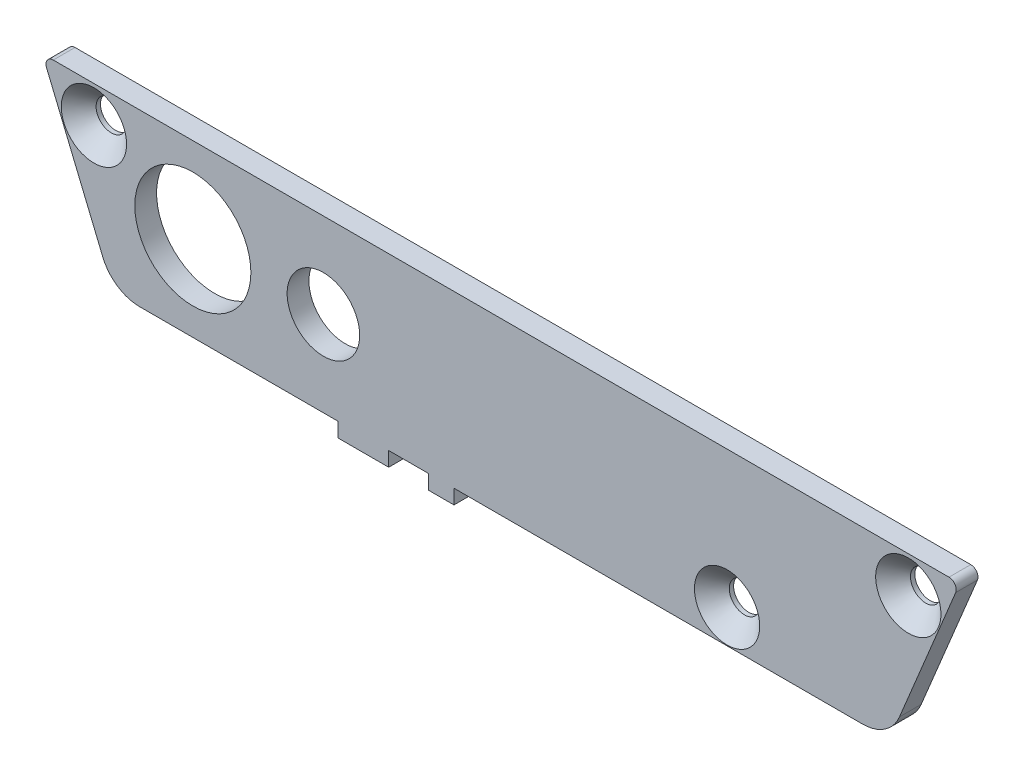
from build123d import *

# Parameters (mm, degrees)
BOSS_EXTRU_1_DEPTH                          = 3
FRAISAGE_POUR_VIS_T_TE_FRAIS_E_M41_AT_COUNT = 2
FRAISAGE_POUR_VIS_T_TE_FRAIS_E_M41_AT_PITCH = 88.387689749
FRAISAGE_POUR_VIS_T_TE_FRAIS_E_M41_2_COUNT  = 2
FRAISAGE_POUR_VIS_T_TE_FRAIS_E_M41_2_PITCH  = 112.275756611
ENL_V_MAT_EXTRU_1_REACH                     = 154.357
ESQUISSE5_R                                 = 8
ESQUISSE5_R_2                               = 5


with BuildPart() as part:
    # Esquisse2 → Boss.-Extru.1 (new body)
    with BuildSketch(Plane.XY.offset(134.349627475)):
        with BuildLine():
            Line((130.529448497, 76.836149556), (7.038520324, 76.836149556))
            ThreePointArc((7.038520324, 76.836149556), (6.207050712, 76.391719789), (6.114640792, 75.453466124))
            Line((6.114640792, 75.453466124), (13.869578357, 56.731390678))
            ThreePointArc((13.869578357, 56.731390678), (15.136877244, 54.873434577), (17.041914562, 53.678076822))
            ThreePointArc((17.041914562, 53.678076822), (17.981225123, 53.422306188), (18.950915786, 53.336149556))
            Line((18.950915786, 53.336149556), (46.283984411, 53.336149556))
            Line((46.283984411, 53.336149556), (46.283984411, 51.336149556))
            Line((46.283984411, 51.336149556), (53.283984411, 51.336149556))
            Line((53.283984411, 51.336149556), (53.283984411, 53.336149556))
            Line((53.283984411, 53.336149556), (58.783984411, 53.336149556))
            Line((58.783984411, 53.336149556), (58.783984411, 51.336149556))
            Line((58.783984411, 51.336149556), (62.283984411, 51.336149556))
            Line((62.283984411, 51.336149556), (62.283984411, 53.336149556))
            Line((62.283984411, 53.336149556), (118.617053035, 53.336149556))
            ThreePointArc((118.617053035, 53.336149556), (121.672689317, 54.263066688), (123.698390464, 56.731390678))
            Line((123.698390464, 56.731390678), (131.453328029, 75.453466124))
            ThreePointArc((131.453328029, 75.453466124), (131.360918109, 76.391719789), (130.529448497, 76.836149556))
        make_face()
    extrude(amount=-BOSS_EXTRU_1_DEPTH)

    # Esquisse4 → Fraisage pour vis _ t_te frais_e M41 (revolve, cut)
    with BuildSketch(Plane(origin=(12.646106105, 71.836149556, 134.349627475), x_dir=(0, -1, 0), z_dir=(1, 0, 0))):
        Polygon((0, 0), (0, 3), (2.1, 3), (2.1, 2.4), (4.5, 0), align=None)
    fraisage_pour_vis_t_te_frais_e_m41 = revolve(axis=Axis((12.646106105, 71.836149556, 140.699627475), (0, 0, -1)), mode=Mode.SUBTRACT)

    # Fraisage pour vis _ t_te frais_e M41 at: Fraisage pour vis _ t_te frais_e M41 ×2
    with Locations(*[Vector(0.9875569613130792, -0.15726171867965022, 0) * (i * FRAISAGE_POUR_VIS_T_TE_FRAIS_E_M41_AT_PITCH) for i in range(1, FRAISAGE_POUR_VIS_T_TE_FRAIS_E_M41_AT_COUNT)]):
        add(fraisage_pour_vis_t_te_frais_e_m41, mode=Mode.SUBTRACT)

    # Fraisage pour vis _ t_te frais_e M41 2: Fraisage pour vis _ t_te frais_e M41 ×2
    with Locations(*[(i * FRAISAGE_POUR_VIS_T_TE_FRAIS_E_M41_2_PITCH, 0, 0) for i in range(1, FRAISAGE_POUR_VIS_T_TE_FRAIS_E_M41_2_COUNT)]):
        add(fraisage_pour_vis_t_te_frais_e_m41, mode=Mode.SUBTRACT)

    # Esquisse5 → Enl_v. mat.-Extru.1 (cut, up to next)
    with BuildSketch(Plane.XY.offset(134.349627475), mode=Mode.PRIVATE) as enl_v_mat_extru_1_sk1:
        with Locations((26.283984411, 65.086149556)):
            Circle(ESQUISSE5_R)
    enl_v_mat_extru_1_tool1 = extrude(enl_v_mat_extru_1_sk1.sketch, amount=-ENL_V_MAT_EXTRU_1_REACH, mode=Mode.PRIVATE) & part.part
    # Esquisse5 → Enl_v. mat.-Extru.1 (cut, up to next)
    with BuildSketch(Plane.XY.offset(134.349627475), mode=Mode.PRIVATE) as enl_v_mat_extru_1_sk2:
        with Locations((44.283984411, 65.086149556)):
            Circle(ESQUISSE5_R_2)
    enl_v_mat_extru_1_tool2 = extrude(enl_v_mat_extru_1_sk2.sketch, amount=-ENL_V_MAT_EXTRU_1_REACH, mode=Mode.PRIVATE) & part.part
    add(enl_v_mat_extru_1_tool1.solids().sort_by_distance((26.283984, 65.08615, 134.349627))[0], mode=Mode.SUBTRACT)
    add(enl_v_mat_extru_1_tool2.solids().sort_by_distance((44.283984, 65.08615, 134.349627))[0], mode=Mode.SUBTRACT)


solid = part.part
